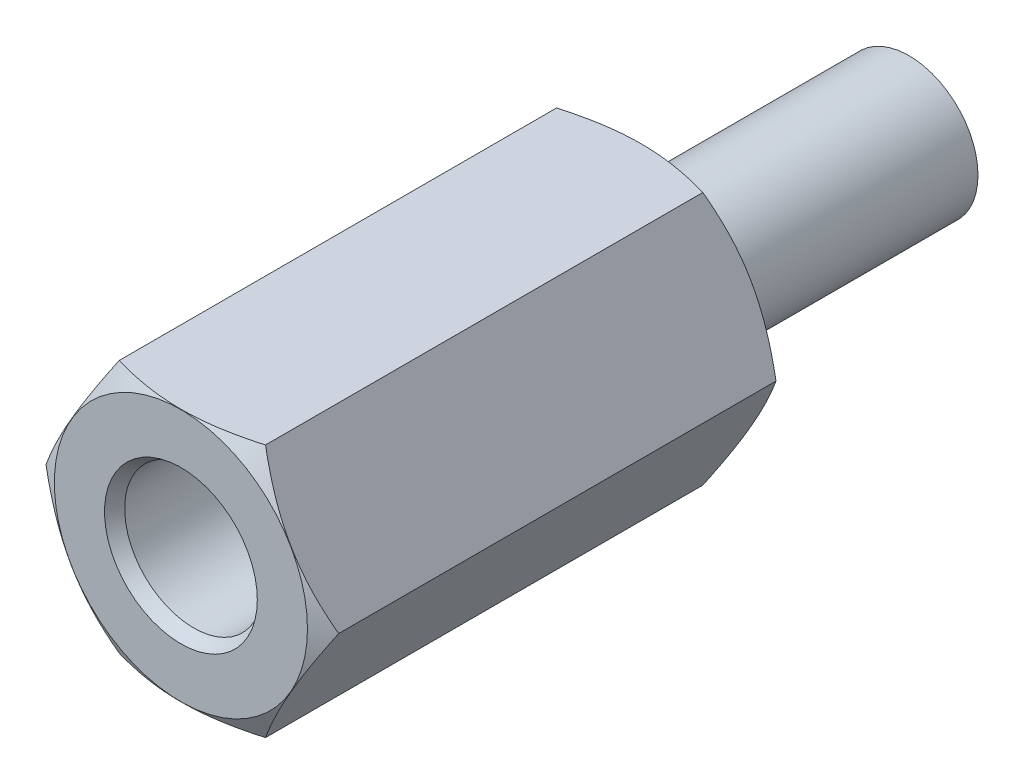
ISO-10303-21;
HEADER;
FILE_DESCRIPTION(('STEP AP214'),'2;1');
FILE_NAME('part.step','',(''),(''),'','','');
FILE_SCHEMA(('AUTOMOTIVE_DESIGN { 1 0 10303 214 1 1 1 1 }'));
ENDSEC;
DATA;
#1=APPLICATION_CONTEXT('core data for automotive mechanical design processes');
#2=APPLICATION_PROTOCOL_DEFINITION('international standard','automotive_design',2000,#1);
#3=PRODUCT_CONTEXT('',#1,'mechanical');
#4=PRODUCT('Part','Part','',(#3));
#5=PRODUCT_RELATED_PRODUCT_CATEGORY('part','',(#4));
#6=PRODUCT_DEFINITION_FORMATION('','',#4);
#7=PRODUCT_DEFINITION_CONTEXT('part definition',#1,'design');
#8=PRODUCT_DEFINITION('design','',#6,#7);
#9=PRODUCT_DEFINITION_SHAPE('','',#8);
#10=(LENGTH_UNIT() NAMED_UNIT(*) SI_UNIT(.MILLI.,.METRE.));
#11=(NAMED_UNIT(*) PLANE_ANGLE_UNIT() SI_UNIT($,.RADIAN.));
#12=(NAMED_UNIT(*) SI_UNIT($,.STERADIAN.) SOLID_ANGLE_UNIT());
#13=UNCERTAINTY_MEASURE_WITH_UNIT(LENGTH_MEASURE(1.E-05),#10,'distance_accuracy_value','');
#14=(GEOMETRIC_REPRESENTATION_CONTEXT(3) GLOBAL_UNCERTAINTY_ASSIGNED_CONTEXT((#13)) GLOBAL_UNIT_ASSIGNED_CONTEXT((#10,
#11,#12)) REPRESENTATION_CONTEXT('',''));
#15=CARTESIAN_POINT('',(0.,0.,0.));
#16=DIRECTION('',(0.,0.,1.));
#17=DIRECTION('',(1.,0.,0.));
#18=AXIS2_PLACEMENT_3D('',#15,#16,#17);
#19=CARTESIAN_POINT('',(0.,-1.03611947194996E-13,4.61641551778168));
#20=DIRECTION('',(0.,0.,1.));
#21=DIRECTION('',(1.00000000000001,0.,0.));
#22=AXIS2_PLACEMENT_3D('',#19,#20,#21);
#23=CONICAL_SURFACE('',#22,3.,1.047197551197);
#24=CARTESIAN_POINT('',(0.,-1.03611947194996E-13,4.61641551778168));
#25=DIRECTION('',(0.,0.,1.));
#26=DIRECTION('',(1.00000000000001,0.,0.));
#27=AXIS2_PLACEMENT_3D('',#24,#25,#26);
#28=CIRCLE('',#27,3.);
#29=CARTESIAN_POINT('',(3.00000000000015,0.,4.61641551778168));
#30=VERTEX_POINT('',#29);
#31=EDGE_CURVE('P0_E47',#30,#30,#28,.T.);
#32=ORIENTED_EDGE('',*,*,#31,.T.);
#33=DIRECTION('',(-0.866025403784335,0.,-0.50000000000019));
#34=VECTOR('',#33,1.);
#35=CARTESIAN_POINT('',(3.00000000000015,0.,4.61641551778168));
#36=LINE('',#35,#34);
#37=CARTESIAN_POINT('',(0.,-1.03611947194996E-13,2.88436471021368));
#38=VERTEX_POINT('',#37);
#39=EDGE_CURVE('P0_E11',#30,#38,#36,.T.);
#40=ORIENTED_EDGE('',*,*,#39,.T.);
#41=ORIENTED_EDGE('',*,*,#39,.F.);
#42=EDGE_LOOP('',(#32,#40,#41));
#43=FACE_BOUND('',#42,.T.);
#44=ADVANCED_FACE('P0_F38',(#43),#23,.F.);
#45=CARTESIAN_POINT('',(0.,-1.03611947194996E-13,-15.3835844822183));
#46=DIRECTION('',(0.,0.,1.));
#47=DIRECTION('',(1.00000000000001,0.,0.));
#48=AXIS2_PLACEMENT_3D('',#45,#46,#47);
#49=PLANE('',#48);
#50=CARTESIAN_POINT('',(0.,-1.03611947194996E-13,-15.3835844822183));
#51=DIRECTION('',(0.,0.,1.));
#52=DIRECTION('',(1.00000000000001,0.,0.));
#53=AXIS2_PLACEMENT_3D('',#50,#51,#52);
#54=CIRCLE('',#53,2.38);
#55=CARTESIAN_POINT('',(2.38000000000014,-1.59123098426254E-13,-15.3835844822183));
#56=VERTEX_POINT('',#55);
#57=EDGE_CURVE('P0_E169',#56,#56,#54,.T.);
#58=ORIENTED_EDGE('',*,*,#57,.F.);
#59=EDGE_LOOP('',(#58));
#60=FACE_BOUND('',#59,.T.);
#61=ADVANCED_FACE('P0_F326',(#60),#49,.F.);
#62=CARTESIAN_POINT('',(0.,-1.03611947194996E-13,16.0621592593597));
#63=DIRECTION('',(0.,0.,-1.));
#64=DIRECTION('',(1.00000000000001,0.,0.));
#65=AXIS2_PLACEMENT_3D('',#62,#63,#64);
#66=CYLINDRICAL_SURFACE('',#65,3.);
#67=CARTESIAN_POINT('',(0.,-1.03611947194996E-13,16.0621592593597));
#68=DIRECTION('',(0.,0.,1.));
#69=DIRECTION('',(1.00000000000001,0.,0.));
#70=AXIS2_PLACEMENT_3D('',#67,#68,#69);
#71=CIRCLE('',#70,3.);
#72=CARTESIAN_POINT('',(3.00000000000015,0.,16.0621592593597));
#73=VERTEX_POINT('',#72);
#74=EDGE_CURVE('P0_E212',#73,#73,#71,.T.);
#75=ORIENTED_EDGE('',*,*,#74,.T.);
#76=DIRECTION('',(0.,0.,-1.));
#77=VECTOR('',#76,1.);
#78=CARTESIAN_POINT('',(3.00000000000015,0.,16.0621592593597));
#79=LINE('',#78,#77);
#80=EDGE_CURVE('P0_E168',#73,#30,#79,.T.);
#81=ORIENTED_EDGE('',*,*,#80,.T.);
#82=ORIENTED_EDGE('',*,*,#31,.F.);
#83=ORIENTED_EDGE('',*,*,#80,.F.);
#84=EDGE_LOOP('',(#75,#81,#82,#83));
#85=FACE_BOUND('',#84,.T.);
#86=ADVANCED_FACE('P0_F330',(#85),#66,.F.);
#87=CARTESIAN_POINT('',(0.,-1.03611947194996E-13,-15.3835844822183));
#88=DIRECTION('',(0.,0.,1.));
#89=DIRECTION('',(1.00000000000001,0.,0.));
#90=AXIS2_PLACEMENT_3D('',#87,#88,#89);
#91=CONICAL_SURFACE('',#90,2.38,1.047197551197);
#92=ORIENTED_EDGE('',*,*,#57,.T.);
#93=DIRECTION('',(0.866025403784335,0.,0.50000000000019));
#94=VECTOR('',#93,1.);
#95=CARTESIAN_POINT('',(2.38000000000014,-1.59123098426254E-13,-15.3835844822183));
#96=LINE('',#95,#94);
#97=CARTESIAN_POINT('',(3.00000000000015,0.,-15.0256273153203));
#98=VERTEX_POINT('',#97);
#99=EDGE_CURVE('P0_E163',#56,#98,#96,.T.);
#100=ORIENTED_EDGE('',*,*,#99,.T.);
#101=CARTESIAN_POINT('',(0.,-1.03611947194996E-13,-15.0256273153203));
#102=DIRECTION('',(0.,0.,1.));
#103=DIRECTION('',(1.00000000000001,0.,0.));
#104=AXIS2_PLACEMENT_3D('',#101,#102,#103);
#105=CIRCLE('',#104,3.);
#106=EDGE_CURVE('P0_E181',#98,#98,#105,.T.);
#107=ORIENTED_EDGE('',*,*,#106,.F.);
#108=ORIENTED_EDGE('',*,*,#99,.F.);
#109=EDGE_LOOP('',(#92,#100,#107,#108));
#110=FACE_BOUND('',#109,.T.);
#111=ADVANCED_FACE('P0_F272',(#110),#91,.T.);
#112=CARTESIAN_POINT('',(0.,-1.03611947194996E-13,16.6164155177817));
#113=DIRECTION('',(0.,0.,1.));
#114=DIRECTION('',(1.00000000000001,0.,0.));
#115=AXIS2_PLACEMENT_3D('',#112,#113,#114);
#116=CONICAL_SURFACE('',#115,3.32,0.523598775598);
#117=CARTESIAN_POINT('',(0.,-1.03611947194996E-13,16.6164155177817));
#118=DIRECTION('',(0.,0.,1.));
#119=DIRECTION('',(1.00000000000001,0.,0.));
#120=AXIS2_PLACEMENT_3D('',#117,#118,#119);
#121=CIRCLE('',#120,3.32);
#122=CARTESIAN_POINT('',(3.32000000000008,0.,16.6164155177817));
#123=VERTEX_POINT('',#122);
#124=EDGE_CURVE('P0_E188',#123,#123,#121,.T.);
#125=ORIENTED_EDGE('',*,*,#124,.T.);
#126=DIRECTION('',(-0.500000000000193,0.,-0.866025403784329));
#127=VECTOR('',#126,1.);
#128=CARTESIAN_POINT('',(3.32000000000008,0.,16.6164155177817));
#129=LINE('',#128,#127);
#130=EDGE_CURVE('P0_E218',#123,#73,#129,.T.);
#131=ORIENTED_EDGE('',*,*,#130,.T.);
#132=ORIENTED_EDGE('',*,*,#74,.F.);
#133=ORIENTED_EDGE('',*,*,#130,.F.);
#134=EDGE_LOOP('',(#125,#131,#132,#133));
#135=FACE_BOUND('',#134,.T.);
#136=ADVANCED_FACE('P0_F336',(#135),#116,.F.);
#137=CARTESIAN_POINT('',(0.,-1.03611947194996E-13,-15.0256273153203));
#138=DIRECTION('',(0.,0.,1.));
#139=DIRECTION('',(1.00000000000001,0.,0.));
#140=AXIS2_PLACEMENT_3D('',#137,#138,#139);
#141=CYLINDRICAL_SURFACE('',#140,3.);
#142=ORIENTED_EDGE('',*,*,#106,.T.);
#143=DIRECTION('',(0.,0.,1.));
#144=VECTOR('',#143,1.);
#145=CARTESIAN_POINT('',(3.00000000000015,0.,-15.0256273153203));
#146=LINE('',#145,#144);
#147=CARTESIAN_POINT('',(3.00000000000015,0.,-3.38358448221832));
#148=VERTEX_POINT('',#147);
#149=EDGE_CURVE('P0_E187',#98,#148,#146,.T.);
#150=ORIENTED_EDGE('',*,*,#149,.T.);
#151=CARTESIAN_POINT('',(0.,-1.03611947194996E-13,-3.38358448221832));
#152=DIRECTION('',(0.,0.,1.));
#153=DIRECTION('',(1.00000000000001,0.,0.));
#154=AXIS2_PLACEMENT_3D('',#151,#152,#153);
#155=CIRCLE('',#154,3.);
#156=EDGE_CURVE('P0_E189',#148,#148,#155,.T.);
#157=ORIENTED_EDGE('',*,*,#156,.F.);
#158=ORIENTED_EDGE('',*,*,#149,.F.);
#159=EDGE_LOOP('',(#142,#150,#157,#158));
#160=FACE_BOUND('',#159,.T.);
#161=ADVANCED_FACE('P0_F268',(#160),#141,.T.);
#162=CARTESIAN_POINT('',(0.,-1.03611947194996E-13,16.6164155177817));
#163=DIRECTION('',(0.,0.,1.));
#164=DIRECTION('',(1.00000000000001,0.,0.));
#165=AXIS2_PLACEMENT_3D('',#162,#163,#164);
#166=PLANE('',#165);
#167=ORIENTED_EDGE('',*,*,#124,.F.);
#168=EDGE_LOOP('',(#167));
#169=FACE_BOUND('',#168,.T.);
#170=CARTESIAN_POINT('',(0.,-1.03611947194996E-13,16.6164155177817));
#171=DIRECTION('',(0.,0.,1.));
#172=DIRECTION('',(1.00000000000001,0.,0.));
#173=AXIS2_PLACEMENT_3D('',#170,#171,#172);
#174=CIRCLE('',#173,5.5);
#175=CARTESIAN_POINT('',(5.50000000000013,0.,16.6164155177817));
#176=VERTEX_POINT('',#175);
#177=EDGE_CURVE('P0_E134',#176,#176,#174,.T.);
#178=ORIENTED_EDGE('',*,*,#177,.T.);
#179=EDGE_LOOP('',(#178));
#180=FACE_BOUND('',#179,.T.);
#181=ADVANCED_FACE('P0_F314',(#169,#180),#166,.T.);
#182=CARTESIAN_POINT('',(0.,-1.03611947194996E-13,-3.38358448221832));
#183=DIRECTION('',(0.,0.,1.));
#184=DIRECTION('',(1.00000000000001,0.,0.));
#185=AXIS2_PLACEMENT_3D('',#182,#183,#184);
#186=PLANE('',#185);
#187=CARTESIAN_POINT('',(0.,-1.03611947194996E-13,-3.38358448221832));
#188=DIRECTION('',(0.,0.,1.));
#189=DIRECTION('',(1.00000000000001,0.,0.));
#190=AXIS2_PLACEMENT_3D('',#187,#188,#189);
#191=CIRCLE('',#190,5.5);
#192=CARTESIAN_POINT('',(5.50000000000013,0.,-3.38358448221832));
#193=VERTEX_POINT('',#192);
#194=EDGE_CURVE('P0_E211',#193,#193,#191,.T.);
#195=ORIENTED_EDGE('',*,*,#194,.F.);
#196=EDGE_LOOP('',(#195));
#197=FACE_BOUND('',#196,.T.);
#198=ORIENTED_EDGE('',*,*,#156,.T.);
#199=EDGE_LOOP('',(#198));
#200=FACE_BOUND('',#199,.T.);
#201=ADVANCED_FACE('P0_F265',(#197,#200),#186,.F.);
#202=CARTESIAN_POINT('',(-3.17999999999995,-5.50792156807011,-23.3835844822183));
#203=DIRECTION('',(0.,1.00000000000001,0.));
#204=DIRECTION('',(1.00000000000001,0.,0.));
#205=AXIS2_PLACEMENT_3D('',#202,#203,#204);
#206=PLANE('',#205);
#207=DIRECTION('',(0.,0.,1.));
#208=VECTOR('',#207,1.);
#209=CARTESIAN_POINT('',(3.18000000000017,-5.50792156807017,-23.3835844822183));
#210=LINE('',#209,#208);
#211=CARTESIAN_POINT('',(3.18000000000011,-5.50792156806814,-2.88706325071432));
#212=VERTEX_POINT('',#211);
#213=CARTESIAN_POINT('',(3.18000000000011,-5.50792156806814,16.1198942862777));
#214=VERTEX_POINT('',#213);
#215=EDGE_CURVE('P0_E220',#212,#214,#210,.T.);
#216=ORIENTED_EDGE('',*,*,#215,.T.);
#217=CARTESIAN_POINT('',(3.17999999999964,-5.50792156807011,16.119894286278));
#218=CARTESIAN_POINT('',(-2.69582349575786E-13,-5.50792156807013,17.037881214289));
#219=CARTESIAN_POINT('',(-3.18000000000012,-5.50792156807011,16.1198942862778));
#220=(BOUNDED_CURVE() B_SPLINE_CURVE(2,(#217,#218,#219),.UNSPECIFIED.,.F.,
.F.) B_SPLINE_CURVE_WITH_KNOTS((3,3),(0.,1.),
.UNSPECIFIED.) CURVE() GEOMETRIC_REPRESENTATION_ITEM() RATIONAL_B_SPLINE_CURVE((1.,
1.15470053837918,1.)) REPRESENTATION_ITEM(''));
#221=CARTESIAN_POINT('',(-3.17999999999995,-5.50792156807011,16.1198942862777));
#222=VERTEX_POINT('',#221);
#223=EDGE_CURVE('P0_E140',#214,#222,#220,.T.);
#224=ORIENTED_EDGE('',*,*,#223,.T.);
#225=DIRECTION('',(0.,0.,1.));
#226=VECTOR('',#225,1.);
#227=CARTESIAN_POINT('',(-3.17999999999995,-5.50792156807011,-23.3835844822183));
#228=LINE('',#227,#226);
#229=CARTESIAN_POINT('',(-3.17999999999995,-5.50792156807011,-2.88706325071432));
#230=VERTEX_POINT('',#229);
#231=EDGE_CURVE('P0_E110',#230,#222,#228,.T.);
#232=ORIENTED_EDGE('',*,*,#231,.F.);
#233=CARTESIAN_POINT('',(-3.17999999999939,-5.50792156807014,-2.88706325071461));
#234=CARTESIAN_POINT('',(2.83269422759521E-13,-5.50792156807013,-3.80505017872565));
#235=CARTESIAN_POINT('',(3.18000000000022,-5.50792156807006,-2.88706325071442));
#236=(BOUNDED_CURVE() B_SPLINE_CURVE(2,(#233,#234,#235),.UNSPECIFIED.,.F.,
.F.) B_SPLINE_CURVE_WITH_KNOTS((3,3),(0.,1.),
.UNSPECIFIED.) CURVE() GEOMETRIC_REPRESENTATION_ITEM() RATIONAL_B_SPLINE_CURVE((1.,
1.15470053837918,1.)) REPRESENTATION_ITEM(''));
#237=EDGE_CURVE('P0_E197',#230,#212,#236,.T.);
#238=ORIENTED_EDGE('',*,*,#237,.T.);
#239=EDGE_LOOP('',(#216,#224,#232,#238));
#240=FACE_BOUND('',#239,.T.);
#241=ADVANCED_FACE('P0_F306',(#240),#206,.F.);
#242=CARTESIAN_POINT('',(-6.35999999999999,-1.38306416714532E-13,-23.3835844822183));
#243=DIRECTION('',(0.866025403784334,0.500000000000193,0.));
#244=DIRECTION('',(0.,0.,-1.));
#245=AXIS2_PLACEMENT_3D('',#242,#243,#244);
#246=PLANE('',#245);
#247=ORIENTED_EDGE('',*,*,#231,.T.);
#248=CARTESIAN_POINT('',(-3.1799999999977,-5.5079215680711,16.1198942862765));
#249=CARTESIAN_POINT('',(-4.7699999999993,-2.75396078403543,17.0378812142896));
#250=CARTESIAN_POINT('',(-6.36000000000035,-3.25656552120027E-13,16.1198942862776));
#251=(BOUNDED_CURVE() B_SPLINE_CURVE(2,(#248,#249,#250),.UNSPECIFIED.,.F.,
.F.) B_SPLINE_CURVE_WITH_KNOTS((3,3),(0.,1.),
.UNSPECIFIED.) CURVE() GEOMETRIC_REPRESENTATION_ITEM() RATIONAL_B_SPLINE_CURVE((1.,
1.15470053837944,1.)) REPRESENTATION_ITEM(''));
#252=CARTESIAN_POINT('',(-6.35999999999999,0.,16.1198942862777));
#253=VERTEX_POINT('',#252);
#254=EDGE_CURVE('P0_E174',#222,#253,#251,.T.);
#255=ORIENTED_EDGE('',*,*,#254,.T.);
#256=DIRECTION('',(0.,0.,1.));
#257=VECTOR('',#256,1.);
#258=CARTESIAN_POINT('',(-6.35999999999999,-1.38306416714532E-13,-23.3835844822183));
#259=LINE('',#258,#257);
#260=CARTESIAN_POINT('',(-6.35999999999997,-2.49328719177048E-13,-2.88706325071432));
#261=VERTEX_POINT('',#260);
#262=EDGE_CURVE('P0_E103',#261,#253,#259,.T.);
#263=ORIENTED_EDGE('',*,*,#262,.F.);
#264=CARTESIAN_POINT('',(-6.3600000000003,-3.88106597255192E-13,-2.88706325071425));
#265=CARTESIAN_POINT('',(-4.76999999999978,-2.75396078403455,-3.80505017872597));
#266=CARTESIAN_POINT('',(-3.17999999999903,-5.5079215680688,-2.88706325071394));
#267=(BOUNDED_CURVE() B_SPLINE_CURVE(2,(#264,#265,#266),.UNSPECIFIED.,.F.,
.F.) B_SPLINE_CURVE_WITH_KNOTS((3,3),(0.,1.),
.UNSPECIFIED.) CURVE() GEOMETRIC_REPRESENTATION_ITEM() RATIONAL_B_SPLINE_CURVE((1.,
1.15470053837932,1.)) REPRESENTATION_ITEM(''));
#268=EDGE_CURVE('P0_E192',#261,#230,#267,.T.);
#269=ORIENTED_EDGE('',*,*,#268,.T.);
#270=EDGE_LOOP('',(#247,#255,#263,#269));
#271=FACE_BOUND('',#270,.T.);
#272=ADVANCED_FACE('P0_F304',(#271),#246,.F.);
#273=CARTESIAN_POINT('',(-3.17999999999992,5.5079215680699,-23.3835844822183));
#274=DIRECTION('',(0.866025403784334,-0.500000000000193,0.));
#275=DIRECTION('',(0.,0.,-1.));
#276=AXIS2_PLACEMENT_3D('',#273,#274,#275);
#277=PLANE('',#276);
#278=ORIENTED_EDGE('',*,*,#262,.T.);
#279=CARTESIAN_POINT('',(-6.36000000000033,1.18432657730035E-13,16.1198942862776));
#280=CARTESIAN_POINT('',(-4.76999999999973,2.75396078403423,17.0378812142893));
#281=CARTESIAN_POINT('',(-3.17999999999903,5.5079215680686,16.1198942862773));
#282=(BOUNDED_CURVE() B_SPLINE_CURVE(2,(#279,#280,#281),.UNSPECIFIED.,.F.,
.F.) B_SPLINE_CURVE_WITH_KNOTS((3,3),(0.,1.),
.UNSPECIFIED.) CURVE() GEOMETRIC_REPRESENTATION_ITEM() RATIONAL_B_SPLINE_CURVE((1.,
1.15470053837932,1.)) REPRESENTATION_ITEM(''));
#283=CARTESIAN_POINT('',(-3.17999999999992,5.5079215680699,16.1198942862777));
#284=VERTEX_POINT('',#283);
#285=EDGE_CURVE('P0_E170',#253,#284,#282,.T.);
#286=ORIENTED_EDGE('',*,*,#285,.T.);
#287=DIRECTION('',(0.,0.,1.));
#288=VECTOR('',#287,1.);
#289=CARTESIAN_POINT('',(-3.17999999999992,5.5079215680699,-23.3835844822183));
#290=LINE('',#289,#288);
#291=CARTESIAN_POINT('',(-3.17999999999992,5.5079215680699,-2.88706325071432));
#292=VERTEX_POINT('',#291);
#293=EDGE_CURVE('P0_E222',#292,#284,#290,.T.);
#294=ORIENTED_EDGE('',*,*,#293,.F.);
#295=CARTESIAN_POINT('',(-3.17999999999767,5.50792156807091,-2.88706325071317));
#296=CARTESIAN_POINT('',(-4.76999999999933,2.75396078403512,-3.80505017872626));
#297=CARTESIAN_POINT('',(-6.36000000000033,1.18432657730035E-13,-2.88706325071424));
#298=(BOUNDED_CURVE() B_SPLINE_CURVE(2,(#295,#296,#297),.UNSPECIFIED.,.F.,
.F.) B_SPLINE_CURVE_WITH_KNOTS((3,3),(0.,1.),
.UNSPECIFIED.) CURVE() GEOMETRIC_REPRESENTATION_ITEM() RATIONAL_B_SPLINE_CURVE((1.,
1.15470053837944,1.)) REPRESENTATION_ITEM(''));
#299=EDGE_CURVE('P0_E196',#292,#261,#298,.T.);
#300=ORIENTED_EDGE('',*,*,#299,.T.);
#301=EDGE_LOOP('',(#278,#286,#294,#300));
#302=FACE_BOUND('',#301,.T.);
#303=ADVANCED_FACE('P0_F301',(#302),#277,.F.);
#304=CARTESIAN_POINT('',(3.18000000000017,-5.50792156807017,-23.3835844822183));
#305=DIRECTION('',(-0.866025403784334,0.500000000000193,0.));
#306=DIRECTION('',(0.,0.,1.));
#307=AXIS2_PLACEMENT_3D('',#304,#305,#306);
#308=PLANE('',#307);
#309=DIRECTION('',(0.,0.,1.));
#310=VECTOR('',#309,1.);
#311=CARTESIAN_POINT('',(6.36000000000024,-1.10550841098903E-13,-2.88706325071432));
#312=LINE('',#311,#310);
#313=CARTESIAN_POINT('',(6.36000000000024,-1.10550841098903E-13,-2.88706325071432));
#314=VERTEX_POINT('',#313);
#315=CARTESIAN_POINT('',(6.36000000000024,-1.10550841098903E-13,16.1198942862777));
#316=VERTEX_POINT('',#315);
#317=EDGE_CURVE('P0_E144',#314,#316,#312,.T.);
#318=ORIENTED_EDGE('',*,*,#317,.T.);
#319=CARTESIAN_POINT('',(6.36000000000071,0.,16.1198942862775));
#320=CARTESIAN_POINT('',(4.77000000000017,-2.75396078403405,17.0378812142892));
#321=CARTESIAN_POINT('',(3.17999999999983,-5.50792156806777,16.1198942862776));
#322=(BOUNDED_CURVE() B_SPLINE_CURVE(2,(#319,#320,#321),.UNSPECIFIED.,.F.,
.F.) B_SPLINE_CURVE_WITH_KNOTS((3,3),(0.,1.),
.UNSPECIFIED.) CURVE() GEOMETRIC_REPRESENTATION_ITEM() RATIONAL_B_SPLINE_CURVE((1.,
1.15470053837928,1.)) REPRESENTATION_ITEM(''));
#323=EDGE_CURVE('P0_E135',#316,#214,#322,.T.);
#324=ORIENTED_EDGE('',*,*,#323,.T.);
#325=ORIENTED_EDGE('',*,*,#215,.F.);
#326=CARTESIAN_POINT('',(3.17999999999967,-5.50792156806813,-2.88706325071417));
#327=CARTESIAN_POINT('',(4.7700000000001,-2.75396078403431,-3.80505017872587));
#328=CARTESIAN_POINT('',(6.36000000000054,-3.88106597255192E-13,-2.88706325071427));
#329=(BOUNDED_CURVE() B_SPLINE_CURVE(2,(#326,#327,#328),.UNSPECIFIED.,.F.,
.F.) B_SPLINE_CURVE_WITH_KNOTS((3,3),(0.,1.),
.UNSPECIFIED.) CURVE() GEOMETRIC_REPRESENTATION_ITEM() RATIONAL_B_SPLINE_CURVE((1.,
1.15470053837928,1.)) REPRESENTATION_ITEM(''));
#330=EDGE_CURVE('P0_E120',#212,#314,#329,.T.);
#331=ORIENTED_EDGE('',*,*,#330,.T.);
#332=EDGE_LOOP('',(#318,#324,#325,#331));
#333=FACE_BOUND('',#332,.T.);
#334=ADVANCED_FACE('P0_F145',(#333),#308,.F.);
#335=CARTESIAN_POINT('',(0.,-1.03611947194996E-13,16.1198942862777));
#336=DIRECTION('',(0.,0.,-1.));
#337=DIRECTION('',(1.00000000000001,0.,0.));
#338=AXIS2_PLACEMENT_3D('',#335,#336,#337);
#339=CONICAL_SURFACE('',#338,6.36,1.047197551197);
#340=ORIENTED_EDGE('',*,*,#323,.F.);
#341=DIRECTION('',(-0.866025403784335,0.,0.50000000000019));
#342=VECTOR('',#341,1.);
#343=CARTESIAN_POINT('',(6.36000000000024,-1.10550841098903E-13,16.1198942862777));
#344=LINE('',#343,#342);
#345=EDGE_CURVE('P0_E127',#316,#176,#344,.T.);
#346=ORIENTED_EDGE('',*,*,#345,.T.);
#347=ORIENTED_EDGE('',*,*,#177,.F.);
#348=ORIENTED_EDGE('',*,*,#345,.F.);
#349=CARTESIAN_POINT('',(3.17999999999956,5.50792156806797,16.1198942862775));
#350=CARTESIAN_POINT('',(4.77000000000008,2.75396078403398,17.0378812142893));
#351=CARTESIAN_POINT('',(6.36000000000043,2.36393854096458E-13,16.1198942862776));
#352=(BOUNDED_CURVE() B_SPLINE_CURVE(2,(#349,#350,#351),.UNSPECIFIED.,.F.,
.F.) B_SPLINE_CURVE_WITH_KNOTS((3,3),(0.,1.),
.UNSPECIFIED.) CURVE() GEOMETRIC_REPRESENTATION_ITEM() RATIONAL_B_SPLINE_CURVE((1.,
1.15470053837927,1.)) REPRESENTATION_ITEM(''));
#353=CARTESIAN_POINT('',(3.18000000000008,5.50792156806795,16.1198942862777));
#354=VERTEX_POINT('',#353);
#355=EDGE_CURVE('P0_E132',#354,#316,#352,.T.);
#356=ORIENTED_EDGE('',*,*,#355,.F.);
#357=CARTESIAN_POINT('',(-3.17999999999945,5.50792156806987,16.119894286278));
#358=CARTESIAN_POINT('',(2.59232389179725E-13,5.50792156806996,17.037881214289));
#359=CARTESIAN_POINT('',(3.1800000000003,5.50792156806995,16.1198942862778));
#360=(BOUNDED_CURVE() B_SPLINE_CURVE(2,(#357,#358,#359),.UNSPECIFIED.,.F.,
.F.) B_SPLINE_CURVE_WITH_KNOTS((3,3),(0.,1.),
.UNSPECIFIED.) CURVE() GEOMETRIC_REPRESENTATION_ITEM() RATIONAL_B_SPLINE_CURVE((1.,
1.15470053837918,1.)) REPRESENTATION_ITEM(''));
#361=EDGE_CURVE('P0_E141',#284,#354,#360,.T.);
#362=ORIENTED_EDGE('',*,*,#361,.F.);
#363=ORIENTED_EDGE('',*,*,#285,.F.);
#364=ORIENTED_EDGE('',*,*,#254,.F.);
#365=ORIENTED_EDGE('',*,*,#223,.F.);
#366=EDGE_LOOP('',(#340,#346,#347,#348,#356,#362,#363,#364,#365));
#367=FACE_BOUND('',#366,.T.);
#368=ADVANCED_FACE('P0_F129',(#367),#339,.T.);
#369=CARTESIAN_POINT('',(3.18000000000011,5.50792156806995,-23.3835844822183));
#370=DIRECTION('',(0.,-1.00000000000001,0.));
#371=DIRECTION('',(-1.00000000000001,0.,0.));
#372=AXIS2_PLACEMENT_3D('',#369,#370,#371);
#373=PLANE('',#372);
#374=ORIENTED_EDGE('',*,*,#293,.T.);
#375=ORIENTED_EDGE('',*,*,#361,.T.);
#376=DIRECTION('',(0.,0.,1.));
#377=VECTOR('',#376,1.);
#378=CARTESIAN_POINT('',(3.18000000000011,5.50792156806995,-23.3835844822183));
#379=LINE('',#378,#377);
#380=CARTESIAN_POINT('',(3.18000000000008,5.50792156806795,-2.88706325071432));
#381=VERTEX_POINT('',#380);
#382=EDGE_CURVE('P0_E153',#381,#354,#379,.T.);
#383=ORIENTED_EDGE('',*,*,#382,.F.);
#384=CARTESIAN_POINT('',(3.17999999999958,5.50792156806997,-2.88706325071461));
#385=CARTESIAN_POINT('',(-1.73434215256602E-13,5.50792156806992,-3.80505017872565));
#386=CARTESIAN_POINT('',(-3.18000000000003,5.50792156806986,-2.88706325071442));
#387=(BOUNDED_CURVE() B_SPLINE_CURVE(2,(#384,#385,#386),.UNSPECIFIED.,.F.,
.F.) B_SPLINE_CURVE_WITH_KNOTS((3,3),(0.,1.),
.UNSPECIFIED.) CURVE() GEOMETRIC_REPRESENTATION_ITEM() RATIONAL_B_SPLINE_CURVE((1.,
1.15470053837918,1.)) REPRESENTATION_ITEM(''));
#388=EDGE_CURVE('P0_E225',#381,#292,#387,.T.);
#389=ORIENTED_EDGE('',*,*,#388,.T.);
#390=EDGE_LOOP('',(#374,#375,#383,#389));
#391=FACE_BOUND('',#390,.T.);
#392=ADVANCED_FACE('P0_F298',(#391),#373,.F.);
#393=CARTESIAN_POINT('',(0.,-1.03611947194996E-13,-3.38358448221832));
#394=DIRECTION('',(0.,0.,1.));
#395=DIRECTION('',(1.00000000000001,0.,0.));
#396=AXIS2_PLACEMENT_3D('',#393,#394,#395);
#397=CONICAL_SURFACE('',#396,5.5,1.047197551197);
#398=DIRECTION('',(0.866025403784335,0.,0.50000000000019));
#399=VECTOR('',#398,1.);
#400=CARTESIAN_POINT('',(5.50000000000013,0.,-3.38358448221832));
#401=LINE('',#400,#399);
#402=EDGE_CURVE('P0_E204',#193,#314,#401,.T.);
#403=ORIENTED_EDGE('',*,*,#402,.F.);
#404=ORIENTED_EDGE('',*,*,#194,.T.);
#405=ORIENTED_EDGE('',*,*,#402,.T.);
#406=ORIENTED_EDGE('',*,*,#330,.F.);
#407=ORIENTED_EDGE('',*,*,#237,.F.);
#408=ORIENTED_EDGE('',*,*,#268,.F.);
#409=ORIENTED_EDGE('',*,*,#299,.F.);
#410=ORIENTED_EDGE('',*,*,#388,.F.);
#411=CARTESIAN_POINT('',(6.36000000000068,-1.10550841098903E-13,-2.88706325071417));
#412=CARTESIAN_POINT('',(4.77000000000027,2.75396078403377,-3.80505017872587));
#413=CARTESIAN_POINT('',(3.17999999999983,5.50792156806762,-2.88706325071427));
#414=(BOUNDED_CURVE() B_SPLINE_CURVE(2,(#411,#412,#413),.UNSPECIFIED.,.F.,
.F.) B_SPLINE_CURVE_WITH_KNOTS((3,3),(0.,1.),
.UNSPECIFIED.) CURVE() GEOMETRIC_REPRESENTATION_ITEM() RATIONAL_B_SPLINE_CURVE((1.,
1.15470053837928,1.)) REPRESENTATION_ITEM(''));
#415=EDGE_CURVE('P0_E149',#314,#381,#414,.T.);
#416=ORIENTED_EDGE('',*,*,#415,.F.);
#417=EDGE_LOOP('',(#403,#404,#405,#406,#407,#408,#409,#410,#416));
#418=FACE_BOUND('',#417,.T.);
#419=ADVANCED_FACE('P0_F309',(#418),#397,.T.);
#420=CARTESIAN_POINT('',(6.36000000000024,-1.10550841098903E-13,-23.3835844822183));
#421=DIRECTION('',(-0.866025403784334,-0.500000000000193,0.));
#422=DIRECTION('',(-0.500000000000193,0.866025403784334,0.));
#423=AXIS2_PLACEMENT_3D('',#420,#421,#422);
#424=PLANE('',#423);
#425=ORIENTED_EDGE('',*,*,#382,.T.);
#426=ORIENTED_EDGE('',*,*,#355,.T.);
#427=ORIENTED_EDGE('',*,*,#317,.F.);
#428=ORIENTED_EDGE('',*,*,#415,.T.);
#429=EDGE_LOOP('',(#425,#426,#427,#428));
#430=FACE_BOUND('',#429,.T.);
#431=ADVANCED_FACE('P0_F151',(#430),#424,.F.);
#432=CLOSED_SHELL('',(#44,#61,#86,#111,#136,#161,#181,#201,#241,#272,#303,#334,#368,#392,#419,#431));
#433=MANIFOLD_SOLID_BREP('P0_B2',#432);
#434=CARTESIAN_POINT('',(0.,0.,4.));
#435=DIRECTION('',(0.,0.,1.));
#436=DIRECTION('',(1.00000000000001,0.,0.));
#437=AXIS2_PLACEMENT_3D('',#434,#435,#436);
#438=CONICAL_SURFACE('',#437,1.5,1.047197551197);
#439=CARTESIAN_POINT('',(0.,0.,4.));
#440=DIRECTION('',(0.,0.,1.));
#441=DIRECTION('',(1.00000000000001,0.,0.));
#442=AXIS2_PLACEMENT_3D('',#439,#440,#441);
#443=CIRCLE('',#442,1.5);
#444=CARTESIAN_POINT('',(1.50000000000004,0.,4.));
#445=VERTEX_POINT('',#444);
#446=EDGE_CURVE('P1_E28',#445,#445,#443,.T.);
#447=ORIENTED_EDGE('',*,*,#446,.T.);
#448=DIRECTION('',(-0.866025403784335,0.,-0.50000000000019));
#449=VECTOR('',#448,1.);
#450=CARTESIAN_POINT('',(1.50000000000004,0.,4.));
#451=LINE('',#450,#449);
#452=CARTESIAN_POINT('',(0.,0.,3.133974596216));
#453=VERTEX_POINT('',#452);
#454=EDGE_CURVE('P1_E11',#445,#453,#451,.T.);
#455=ORIENTED_EDGE('',*,*,#454,.T.);
#456=ORIENTED_EDGE('',*,*,#454,.F.);
#457=EDGE_LOOP('',(#447,#455,#456));
#458=FACE_BOUND('',#457,.T.);
#459=ADVANCED_FACE('P1_F16',(#458),#438,.F.);
#460=CARTESIAN_POINT('',(0.,0.,-6.));
#461=DIRECTION('',(0.,0.,1.));
#462=DIRECTION('',(1.00000000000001,0.,0.));
#463=AXIS2_PLACEMENT_3D('',#460,#461,#462);
#464=PLANE('',#463);
#465=CARTESIAN_POINT('',(0.,0.,-6.));
#466=DIRECTION('',(0.,0.,1.));
#467=DIRECTION('',(1.00000000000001,0.,0.));
#468=AXIS2_PLACEMENT_3D('',#465,#466,#467);
#469=CIRCLE('',#468,1.19);
#470=CARTESIAN_POINT('',(1.19000000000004,0.,-6.));
#471=VERTEX_POINT('',#470);
#472=EDGE_CURVE('P1_E193',#471,#471,#469,.T.);
#473=ORIENTED_EDGE('',*,*,#472,.F.);
#474=EDGE_LOOP('',(#473));
#475=FACE_BOUND('',#474,.T.);
#476=ADVANCED_FACE('P1_F296',(#475),#464,.F.);
#477=CARTESIAN_POINT('',(0.,0.,9.722871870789));
#478=DIRECTION('',(0.,0.,-1.));
#479=DIRECTION('',(1.00000000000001,0.,0.));
#480=AXIS2_PLACEMENT_3D('',#477,#478,#479);
#481=CYLINDRICAL_SURFACE('',#480,1.5);
#482=CARTESIAN_POINT('',(0.,0.,9.722871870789));
#483=DIRECTION('',(0.,0.,1.));
#484=DIRECTION('',(1.00000000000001,0.,0.));
#485=AXIS2_PLACEMENT_3D('',#482,#483,#484);
#486=CIRCLE('',#485,1.5);
#487=CARTESIAN_POINT('',(1.50000000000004,0.,9.722871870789));
#488=VERTEX_POINT('',#487);
#489=EDGE_CURVE('P1_E187',#488,#488,#486,.T.);
#490=ORIENTED_EDGE('',*,*,#489,.T.);
#491=DIRECTION('',(0.,0.,-1.));
#492=VECTOR('',#491,1.);
#493=CARTESIAN_POINT('',(1.50000000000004,0.,9.722871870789));
#494=LINE('',#493,#492);
#495=EDGE_CURVE('P1_E192',#488,#445,#494,.T.);
#496=ORIENTED_EDGE('',*,*,#495,.T.);
#497=ORIENTED_EDGE('',*,*,#446,.F.);
#498=ORIENTED_EDGE('',*,*,#495,.F.);
#499=EDGE_LOOP('',(#490,#496,#497,#498));
#500=FACE_BOUND('',#499,.T.);
#501=ADVANCED_FACE('P1_F300',(#500),#481,.F.);
#502=CARTESIAN_POINT('',(0.,0.,-6.));
#503=DIRECTION('',(0.,0.,1.));
#504=DIRECTION('',(1.00000000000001,0.,0.));
#505=AXIS2_PLACEMENT_3D('',#502,#503,#504);
#506=CONICAL_SURFACE('',#505,1.19,1.047197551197);
#507=ORIENTED_EDGE('',*,*,#472,.T.);
#508=DIRECTION('',(0.866025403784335,0.,0.50000000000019));
#509=VECTOR('',#508,1.);
#510=CARTESIAN_POINT('',(1.19000000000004,0.,-6.));
#511=LINE('',#510,#509);
#512=CARTESIAN_POINT('',(1.50000000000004,0.,-5.821021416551));
#513=VERTEX_POINT('',#512);
#514=EDGE_CURVE('P1_E189',#471,#513,#511,.T.);
#515=ORIENTED_EDGE('',*,*,#514,.T.);
#516=CARTESIAN_POINT('',(0.,0.,-5.821021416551));
#517=DIRECTION('',(0.,0.,1.));
#518=DIRECTION('',(1.00000000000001,0.,0.));
#519=AXIS2_PLACEMENT_3D('',#516,#517,#518);
#520=CIRCLE('',#519,1.5);
#521=EDGE_CURVE('P1_E207',#513,#513,#520,.T.);
#522=ORIENTED_EDGE('',*,*,#521,.F.);
#523=ORIENTED_EDGE('',*,*,#514,.F.);
#524=EDGE_LOOP('',(#507,#515,#522,#523));
#525=FACE_BOUND('',#524,.T.);
#526=ADVANCED_FACE('P1_F360',(#525),#506,.T.);
#527=CARTESIAN_POINT('',(0.,0.,10.));
#528=DIRECTION('',(0.,0.,1.));
#529=DIRECTION('',(1.00000000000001,0.,0.));
#530=AXIS2_PLACEMENT_3D('',#527,#528,#529);
#531=CONICAL_SURFACE('',#530,1.66,0.523598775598);
#532=CARTESIAN_POINT('',(0.,0.,10.));
#533=DIRECTION('',(0.,0.,1.));
#534=DIRECTION('',(1.00000000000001,0.,0.));
#535=AXIS2_PLACEMENT_3D('',#532,#533,#534);
#536=CIRCLE('',#535,1.66);
#537=CARTESIAN_POINT('',(1.66000000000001,0.,10.));
#538=VERTEX_POINT('',#537);
#539=EDGE_CURVE('P1_E175',#538,#538,#536,.T.);
#540=ORIENTED_EDGE('',*,*,#539,.T.);
#541=DIRECTION('',(-0.500000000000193,0.,-0.866025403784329));
#542=VECTOR('',#541,1.);
#543=CARTESIAN_POINT('',(1.66000000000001,0.,10.));
#544=LINE('',#543,#542);
#545=EDGE_CURVE('P1_E183',#538,#488,#544,.T.);
#546=ORIENTED_EDGE('',*,*,#545,.T.);
#547=ORIENTED_EDGE('',*,*,#489,.F.);
#548=ORIENTED_EDGE('',*,*,#545,.F.);
#549=EDGE_LOOP('',(#540,#546,#547,#548));
#550=FACE_BOUND('',#549,.T.);
#551=ADVANCED_FACE('P1_F290',(#550),#531,.F.);
#552=CARTESIAN_POINT('',(0.,0.,-5.821021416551));
#553=DIRECTION('',(0.,0.,1.));
#554=DIRECTION('',(1.00000000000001,0.,0.));
#555=AXIS2_PLACEMENT_3D('',#552,#553,#554);
#556=CYLINDRICAL_SURFACE('',#555,1.5);
#557=ORIENTED_EDGE('',*,*,#521,.T.);
#558=DIRECTION('',(0.,0.,1.));
#559=VECTOR('',#558,1.);
#560=CARTESIAN_POINT('',(1.50000000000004,0.,-5.821021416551));
#561=LINE('',#560,#559);
#562=CARTESIAN_POINT('',(1.50000000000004,0.,0.));
#563=VERTEX_POINT('',#562);
#564=EDGE_CURVE('P1_E188',#513,#563,#561,.T.);
#565=ORIENTED_EDGE('',*,*,#564,.T.);
#566=CARTESIAN_POINT('',(0.,0.,0.));
#567=DIRECTION('',(0.,0.,1.));
#568=DIRECTION('',(1.00000000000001,0.,0.));
#569=AXIS2_PLACEMENT_3D('',#566,#567,#568);
#570=CIRCLE('',#569,1.5);
#571=EDGE_CURVE('P1_E215',#563,#563,#570,.T.);
#572=ORIENTED_EDGE('',*,*,#571,.F.);
#573=ORIENTED_EDGE('',*,*,#564,.F.);
#574=EDGE_LOOP('',(#557,#565,#572,#573));
#575=FACE_BOUND('',#574,.T.);
#576=ADVANCED_FACE('P1_F279',(#575),#556,.T.);
#577=CARTESIAN_POINT('',(0.,0.,10.));
#578=DIRECTION('',(0.,0.,1.));
#579=DIRECTION('',(1.00000000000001,0.,0.));
#580=AXIS2_PLACEMENT_3D('',#577,#578,#579);
#581=PLANE('',#580);
#582=ORIENTED_EDGE('',*,*,#539,.F.);
#583=EDGE_LOOP('',(#582));
#584=FACE_BOUND('',#583,.T.);
#585=CARTESIAN_POINT('',(0.,0.,10.));
#586=DIRECTION('',(0.,0.,1.));
#587=DIRECTION('',(1.00000000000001,0.,0.));
#588=AXIS2_PLACEMENT_3D('',#585,#586,#587);
#589=CIRCLE('',#588,2.75);
#590=CARTESIAN_POINT('',(2.75000000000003,0.,10.));
#591=VERTEX_POINT('',#590);
#592=EDGE_CURVE('P1_E144',#591,#591,#589,.T.);
#593=ORIENTED_EDGE('',*,*,#592,.T.);
#594=EDGE_LOOP('',(#593));
#595=FACE_BOUND('',#594,.T.);
#596=ADVANCED_FACE('P1_F276',(#584,#595),#581,.T.);
#597=CARTESIAN_POINT('',(0.,0.,0.));
#598=DIRECTION('',(0.,0.,1.));
#599=DIRECTION('',(1.00000000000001,0.,0.));
#600=AXIS2_PLACEMENT_3D('',#597,#598,#599);
#601=PLANE('',#600);
#602=CARTESIAN_POINT('',(0.,0.,0.));
#603=DIRECTION('',(0.,0.,1.));
#604=DIRECTION('',(1.00000000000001,0.,0.));
#605=AXIS2_PLACEMENT_3D('',#602,#603,#604);
#606=CIRCLE('',#605,2.75);
#607=CARTESIAN_POINT('',(2.75000000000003,0.,0.));
#608=VERTEX_POINT('',#607);
#609=EDGE_CURVE('P1_E177',#608,#608,#606,.T.);
#610=ORIENTED_EDGE('',*,*,#609,.F.);
#611=EDGE_LOOP('',(#610));
#612=FACE_BOUND('',#611,.T.);
#613=ORIENTED_EDGE('',*,*,#571,.T.);
#614=EDGE_LOOP('',(#613));
#615=FACE_BOUND('',#614,.T.);
#616=ADVANCED_FACE('P1_F278',(#612,#615),#601,.F.);
#617=CARTESIAN_POINT('',(-1.59000000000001,-2.753960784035,-10.));
#618=DIRECTION('',(0.,1.00000000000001,0.));
#619=DIRECTION('',(1.00000000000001,0.,0.));
#620=AXIS2_PLACEMENT_3D('',#617,#618,#619);
#621=PLANE('',#620);
#622=DIRECTION('',(0.,0.,1.));
#623=VECTOR('',#622,1.);
#624=CARTESIAN_POINT('',(1.59000000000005,-2.75396078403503,-10.));
#625=LINE('',#624,#623);
#626=CARTESIAN_POINT('',(1.59000000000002,-2.75396078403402,0.248260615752));
#627=VERTEX_POINT('',#626);
#628=CARTESIAN_POINT('',(1.59000000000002,-2.75396078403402,9.751739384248));
#629=VERTEX_POINT('',#628);
#630=EDGE_CURVE('P1_E255',#627,#629,#625,.T.);
#631=ORIENTED_EDGE('',*,*,#630,.T.);
#632=CARTESIAN_POINT('',(1.58999999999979,-2.753960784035,9.75173938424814));
#633=CARTESIAN_POINT('',(-1.68259235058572E-13,-2.75396078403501,10.2107328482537));
#634=CARTESIAN_POINT('',(-1.59000000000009,-2.753960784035,9.75173938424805));
#635=(BOUNDED_CURVE() B_SPLINE_CURVE(2,(#632,#633,#634),.UNSPECIFIED.,.F.,
.F.) B_SPLINE_CURVE_WITH_KNOTS((3,3),(0.,1.),
.UNSPECIFIED.) CURVE() GEOMETRIC_REPRESENTATION_ITEM() RATIONAL_B_SPLINE_CURVE((1.,
1.15470053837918,1.)) REPRESENTATION_ITEM(''));
#636=CARTESIAN_POINT('',(-1.59000000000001,-2.753960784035,9.751739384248));
#637=VERTEX_POINT('',#636);
#638=EDGE_CURVE('P1_E150',#629,#637,#635,.T.);
#639=ORIENTED_EDGE('',*,*,#638,.T.);
#640=DIRECTION('',(0.,0.,1.));
#641=VECTOR('',#640,1.);
#642=CARTESIAN_POINT('',(-1.59000000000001,-2.753960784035,-10.));
#643=LINE('',#642,#641);
#644=CARTESIAN_POINT('',(-1.59000000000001,-2.753960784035,0.248260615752));
#645=VERTEX_POINT('',#644);
#646=EDGE_CURVE('P1_E114',#645,#637,#643,.T.);
#647=ORIENTED_EDGE('',*,*,#646,.F.);
#648=CARTESIAN_POINT('',(-1.58999999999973,-2.75396078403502,0.248260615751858));
#649=CARTESIAN_POINT('',(1.08166651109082E-13,-2.75396078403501,-0.210732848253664));
#650=CARTESIAN_POINT('',(1.59000000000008,-2.75396078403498,0.248260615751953));
#651=(BOUNDED_CURVE() B_SPLINE_CURVE(2,(#648,#649,#650),.UNSPECIFIED.,.F.,
.F.) B_SPLINE_CURVE_WITH_KNOTS((3,3),(0.,1.),
.UNSPECIFIED.) CURVE() GEOMETRIC_REPRESENTATION_ITEM() RATIONAL_B_SPLINE_CURVE((1.,
1.15470053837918,1.)) REPRESENTATION_ITEM(''));
#652=EDGE_CURVE('P1_E229',#645,#627,#651,.T.);
#653=ORIENTED_EDGE('',*,*,#652,.T.);
#654=EDGE_LOOP('',(#631,#639,#647,#653));
#655=FACE_BOUND('',#654,.T.);
#656=ADVANCED_FACE('P1_F287',(#655),#621,.F.);
#657=CARTESIAN_POINT('',(-3.18000000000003,0.,-10.));
#658=DIRECTION('',(0.866025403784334,0.500000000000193,0.));
#659=DIRECTION('',(0.,0.,-1.));
#660=AXIS2_PLACEMENT_3D('',#657,#658,#659);
#661=PLANE('',#660);
#662=ORIENTED_EDGE('',*,*,#646,.T.);
#663=CARTESIAN_POINT('',(-1.58999999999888,-2.7539607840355,9.75173938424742));
#664=CARTESIAN_POINT('',(-2.38499999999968,-1.37698039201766,10.210732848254));
#665=CARTESIAN_POINT('',(-3.18000000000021,-1.11022302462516E-13,9.75173938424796));
#666=(BOUNDED_CURVE() B_SPLINE_CURVE(2,(#663,#664,#665),.UNSPECIFIED.,.F.,
.F.) B_SPLINE_CURVE_WITH_KNOTS((3,3),(0.,1.),
.UNSPECIFIED.) CURVE() GEOMETRIC_REPRESENTATION_ITEM() RATIONAL_B_SPLINE_CURVE((1.,
1.15470053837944,1.)) REPRESENTATION_ITEM(''));
#667=CARTESIAN_POINT('',(-3.18000000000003,0.,9.751739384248));
#668=VERTEX_POINT('',#667);
#669=EDGE_CURVE('P1_E199',#637,#668,#666,.T.);
#670=ORIENTED_EDGE('',*,*,#669,.T.);
#671=DIRECTION('',(0.,0.,1.));
#672=VECTOR('',#671,1.);
#673=CARTESIAN_POINT('',(-3.18000000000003,0.,-10.));
#674=LINE('',#673,#672);
#675=CARTESIAN_POINT('',(-3.18000000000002,0.,0.248260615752));
#676=VERTEX_POINT('',#675);
#677=EDGE_CURVE('P1_E104',#676,#668,#674,.T.);
#678=ORIENTED_EDGE('',*,*,#677,.F.);
#679=CARTESIAN_POINT('',(-3.18000000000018,-1.42247325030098E-13,0.248260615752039));
#680=CARTESIAN_POINT('',(-2.38499999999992,-1.37698039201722,-0.210732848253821));
#681=CARTESIAN_POINT('',(-1.58999999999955,-2.75396078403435,0.248260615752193));
#682=(BOUNDED_CURVE() B_SPLINE_CURVE(2,(#679,#680,#681),.UNSPECIFIED.,.F.,
.F.) B_SPLINE_CURVE_WITH_KNOTS((3,3),(0.,1.),
.UNSPECIFIED.) CURVE() GEOMETRIC_REPRESENTATION_ITEM() RATIONAL_B_SPLINE_CURVE((1.,
1.15470053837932,1.)) REPRESENTATION_ITEM(''));
#683=EDGE_CURVE('P1_E223',#676,#645,#682,.T.);
#684=ORIENTED_EDGE('',*,*,#683,.T.);
#685=EDGE_LOOP('',(#662,#670,#678,#684));
#686=FACE_BOUND('',#685,.T.);
#687=ADVANCED_FACE('P1_F337',(#686),#661,.F.);
#688=CARTESIAN_POINT('',(-1.58999999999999,2.753960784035,-10.));
#689=DIRECTION('',(0.866025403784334,-0.500000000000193,0.));
#690=DIRECTION('',(0.,0.,-1.));
#691=AXIS2_PLACEMENT_3D('',#688,#689,#690);
#692=PLANE('',#691);
#693=ORIENTED_EDGE('',*,*,#677,.T.);
#694=CARTESIAN_POINT('',(-3.1800000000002,1.11022302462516E-13,9.75173938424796));
#695=CARTESIAN_POINT('',(-2.3849999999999,1.37698039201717,10.2107328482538));
#696=CARTESIAN_POINT('',(-1.58999999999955,2.75396078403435,9.75173938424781));
#697=(BOUNDED_CURVE() B_SPLINE_CURVE(2,(#694,#695,#696),.UNSPECIFIED.,.F.,
.F.) B_SPLINE_CURVE_WITH_KNOTS((3,3),(0.,1.),
.UNSPECIFIED.) CURVE() GEOMETRIC_REPRESENTATION_ITEM() RATIONAL_B_SPLINE_CURVE((1.,
1.15470053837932,1.)) REPRESENTATION_ITEM(''));
#698=CARTESIAN_POINT('',(-1.58999999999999,2.753960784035,9.751739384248));
#699=VERTEX_POINT('',#698);
#700=EDGE_CURVE('P1_E194',#668,#699,#697,.T.);
#701=ORIENTED_EDGE('',*,*,#700,.T.);
#702=DIRECTION('',(0.,0.,1.));
#703=VECTOR('',#702,1.);
#704=CARTESIAN_POINT('',(-1.58999999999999,2.753960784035,-10.));
#705=LINE('',#704,#703);
#706=CARTESIAN_POINT('',(-1.58999999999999,2.753960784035,0.248260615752));
#707=VERTEX_POINT('',#706);
#708=EDGE_CURVE('P1_E258',#707,#699,#705,.T.);
#709=ORIENTED_EDGE('',*,*,#708,.F.);
#710=CARTESIAN_POINT('',(-1.58999999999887,2.75396078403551,0.248260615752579));
#711=CARTESIAN_POINT('',(-2.3849999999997,1.37698039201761,-0.210732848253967));
#712=CARTESIAN_POINT('',(-3.1800000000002,1.11022302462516E-13,0.24826061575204));
#713=(BOUNDED_CURVE() B_SPLINE_CURVE(2,(#710,#711,#712),.UNSPECIFIED.,.F.,
.F.) B_SPLINE_CURVE_WITH_KNOTS((3,3),(0.,1.),
.UNSPECIFIED.) CURVE() GEOMETRIC_REPRESENTATION_ITEM() RATIONAL_B_SPLINE_CURVE((1.,
1.15470053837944,1.)) REPRESENTATION_ITEM(''));
#714=EDGE_CURVE('P1_E228',#707,#676,#713,.T.);
#715=ORIENTED_EDGE('',*,*,#714,.T.);
#716=EDGE_LOOP('',(#693,#701,#709,#715));
#717=FACE_BOUND('',#716,.T.);
#718=ADVANCED_FACE('P1_F350',(#717),#692,.F.);
#719=CARTESIAN_POINT('',(1.59000000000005,-2.75396078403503,-10.));
#720=DIRECTION('',(-0.866025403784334,0.500000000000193,0.));
#721=DIRECTION('',(0.,0.,1.));
#722=AXIS2_PLACEMENT_3D('',#719,#720,#721);
#723=PLANE('',#722);
#724=DIRECTION('',(0.,0.,1.));
#725=VECTOR('',#724,1.);
#726=CARTESIAN_POINT('',(3.18000000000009,0.,0.248260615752));
#727=LINE('',#726,#725);
#728=CARTESIAN_POINT('',(3.18000000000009,0.,0.248260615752));
#729=VERTEX_POINT('',#728);
#730=CARTESIAN_POINT('',(3.18000000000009,0.,9.751739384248));
#731=VERTEX_POINT('',#730);
#732=EDGE_CURVE('P1_E154',#729,#731,#727,.T.);
#733=ORIENTED_EDGE('',*,*,#732,.T.);
#734=CARTESIAN_POINT('',(3.18000000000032,0.,9.75173938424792));
#735=CARTESIAN_POINT('',(2.38500000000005,-1.37698039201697,10.2107328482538));
#736=CARTESIAN_POINT('',(1.58999999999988,-2.75396078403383,9.75173938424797));
#737=(BOUNDED_CURVE() B_SPLINE_CURVE(2,(#734,#735,#736),.UNSPECIFIED.,.F.,
.F.) B_SPLINE_CURVE_WITH_KNOTS((3,3),(0.,1.),
.UNSPECIFIED.) CURVE() GEOMETRIC_REPRESENTATION_ITEM() RATIONAL_B_SPLINE_CURVE((1.,
1.15470053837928,1.)) REPRESENTATION_ITEM(''));
#738=EDGE_CURVE('P1_E19',#731,#629,#737,.T.);
#739=ORIENTED_EDGE('',*,*,#738,.T.);
#740=ORIENTED_EDGE('',*,*,#630,.F.);
#741=CARTESIAN_POINT('',(1.5899999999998,-2.75396078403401,0.248260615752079));
#742=CARTESIAN_POINT('',(2.38500000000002,-1.3769803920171,-0.210732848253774));
#743=CARTESIAN_POINT('',(3.18000000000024,-1.42247325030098E-13,0.248260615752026));
#744=(BOUNDED_CURVE() B_SPLINE_CURVE(2,(#741,#742,#743),.UNSPECIFIED.,.F.,
.F.) B_SPLINE_CURVE_WITH_KNOTS((3,3),(0.,1.),
.UNSPECIFIED.) CURVE() GEOMETRIC_REPRESENTATION_ITEM() RATIONAL_B_SPLINE_CURVE((1.,
1.15470053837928,1.)) REPRESENTATION_ITEM(''));
#745=EDGE_CURVE('P1_E128',#627,#729,#744,.T.);
#746=ORIENTED_EDGE('',*,*,#745,.T.);
#747=EDGE_LOOP('',(#733,#739,#740,#746));
#748=FACE_BOUND('',#747,.T.);
#749=ADVANCED_FACE('P1_F155',(#748),#723,.F.);
#750=CARTESIAN_POINT('',(0.,0.,9.751739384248));
#751=DIRECTION('',(0.,0.,-1.));
#752=DIRECTION('',(1.00000000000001,0.,0.));
#753=AXIS2_PLACEMENT_3D('',#750,#751,#752);
#754=CONICAL_SURFACE('',#753,3.18,1.047197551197);
#755=ORIENTED_EDGE('',*,*,#738,.F.);
#756=DIRECTION('',(-0.866025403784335,0.,0.50000000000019));
#757=VECTOR('',#756,1.);
#758=CARTESIAN_POINT('',(3.18000000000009,0.,9.751739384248));
#759=LINE('',#758,#757);
#760=EDGE_CURVE('P1_E137',#731,#591,#759,.T.);
#761=ORIENTED_EDGE('',*,*,#760,.T.);
#762=ORIENTED_EDGE('',*,*,#592,.F.);
#763=ORIENTED_EDGE('',*,*,#760,.F.);
#764=CARTESIAN_POINT('',(1.58999999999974,2.75396078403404,9.75173938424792));
#765=CARTESIAN_POINT('',(2.385,1.37698039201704,10.2107328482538));
#766=CARTESIAN_POINT('',(3.18000000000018,1.70002900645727E-13,9.75173938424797));
#767=(BOUNDED_CURVE() B_SPLINE_CURVE(2,(#764,#765,#766),.UNSPECIFIED.,.F.,
.F.) B_SPLINE_CURVE_WITH_KNOTS((3,3),(0.,1.),
.UNSPECIFIED.) CURVE() GEOMETRIC_REPRESENTATION_ITEM() RATIONAL_B_SPLINE_CURVE((1.,
1.15470053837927,1.)) REPRESENTATION_ITEM(''));
#768=CARTESIAN_POINT('',(1.59000000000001,2.75396078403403,9.751739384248));
#769=VERTEX_POINT('',#768);
#770=EDGE_CURVE('P1_E142',#769,#731,#767,.T.);
#771=ORIENTED_EDGE('',*,*,#770,.F.);
#772=CARTESIAN_POINT('',(-1.58999999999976,2.75396078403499,9.75173938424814));
#773=CARTESIAN_POINT('',(0.,2.75396078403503,10.2107328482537));
#774=CARTESIAN_POINT('',(1.59000000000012,2.75396078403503,9.75173938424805));
#775=(BOUNDED_CURVE() B_SPLINE_CURVE(2,(#772,#773,#774),.UNSPECIFIED.,.F.,
.F.) B_SPLINE_CURVE_WITH_KNOTS((3,3),(0.,1.),
.UNSPECIFIED.) CURVE() GEOMETRIC_REPRESENTATION_ITEM() RATIONAL_B_SPLINE_CURVE((1.,
1.15470053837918,1.)) REPRESENTATION_ITEM(''));
#776=EDGE_CURVE('P1_E152',#699,#769,#775,.T.);
#777=ORIENTED_EDGE('',*,*,#776,.F.);
#778=ORIENTED_EDGE('',*,*,#700,.F.);
#779=ORIENTED_EDGE('',*,*,#669,.F.);
#780=ORIENTED_EDGE('',*,*,#638,.F.);
#781=EDGE_LOOP('',(#755,#761,#762,#763,#771,#777,#778,#779,#780));
#782=FACE_BOUND('',#781,.T.);
#783=ADVANCED_FACE('P1_F139',(#782),#754,.T.);
#784=CARTESIAN_POINT('',(1.59000000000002,2.75396078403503,-10.));
#785=DIRECTION('',(0.,-1.00000000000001,0.));
#786=DIRECTION('',(-1.00000000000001,0.,0.));
#787=AXIS2_PLACEMENT_3D('',#784,#785,#786);
#788=PLANE('',#787);
#789=ORIENTED_EDGE('',*,*,#708,.T.);
#790=ORIENTED_EDGE('',*,*,#776,.T.);
#791=DIRECTION('',(0.,0.,1.));
#792=VECTOR('',#791,1.);
#793=CARTESIAN_POINT('',(1.59000000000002,2.75396078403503,-10.));
#794=LINE('',#793,#792);
#795=CARTESIAN_POINT('',(1.59000000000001,2.75396078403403,0.248260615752));
#796=VERTEX_POINT('',#795);
#797=EDGE_CURVE('P1_E163',#796,#769,#794,.T.);
#798=ORIENTED_EDGE('',*,*,#797,.F.);
#799=CARTESIAN_POINT('',(1.58999999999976,2.75396078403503,0.248260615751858));
#800=CARTESIAN_POINT('',(-1.2018516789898E-13,2.75396078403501,-0.210732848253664));
#801=CARTESIAN_POINT('',(-1.59000000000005,2.75396078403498,0.248260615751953));
#802=(BOUNDED_CURVE() B_SPLINE_CURVE(2,(#799,#800,#801),.UNSPECIFIED.,.F.,
.F.) B_SPLINE_CURVE_WITH_KNOTS((3,3),(0.,1.),
.UNSPECIFIED.) CURVE() GEOMETRIC_REPRESENTATION_ITEM() RATIONAL_B_SPLINE_CURVE((1.,
1.15470053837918,1.)) REPRESENTATION_ITEM(''));
#803=EDGE_CURVE('P1_E262',#796,#707,#802,.T.);
#804=ORIENTED_EDGE('',*,*,#803,.T.);
#805=EDGE_LOOP('',(#789,#790,#798,#804));
#806=FACE_BOUND('',#805,.T.);
#807=ADVANCED_FACE('P1_F348',(#806),#788,.F.);
#808=CARTESIAN_POINT('',(0.,0.,0.));
#809=DIRECTION('',(0.,0.,1.));
#810=DIRECTION('',(1.00000000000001,0.,0.));
#811=AXIS2_PLACEMENT_3D('',#808,#809,#810);
#812=CONICAL_SURFACE('',#811,2.75,1.047197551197);
#813=DIRECTION('',(0.866025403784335,0.,0.50000000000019));
#814=VECTOR('',#813,1.);
#815=CARTESIAN_POINT('',(2.75000000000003,0.,0.));
#816=LINE('',#815,#814);
#817=EDGE_CURVE('P1_E182',#608,#729,#816,.T.);
#818=ORIENTED_EDGE('',*,*,#817,.F.);
#819=ORIENTED_EDGE('',*,*,#609,.T.);
#820=ORIENTED_EDGE('',*,*,#817,.T.);
#821=ORIENTED_EDGE('',*,*,#745,.F.);
#822=ORIENTED_EDGE('',*,*,#652,.F.);
#823=ORIENTED_EDGE('',*,*,#683,.F.);
#824=ORIENTED_EDGE('',*,*,#714,.F.);
#825=ORIENTED_EDGE('',*,*,#803,.F.);
#826=CARTESIAN_POINT('',(3.18000000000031,0.,0.248260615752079));
#827=CARTESIAN_POINT('',(2.3850000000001,1.37698039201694,-0.210732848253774));
#828=CARTESIAN_POINT('',(1.58999999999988,2.75396078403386,0.248260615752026));
#829=(BOUNDED_CURVE() B_SPLINE_CURVE(2,(#826,#827,#828),.UNSPECIFIED.,.F.,
.F.) B_SPLINE_CURVE_WITH_KNOTS((3,3),(0.,1.),
.UNSPECIFIED.) CURVE() GEOMETRIC_REPRESENTATION_ITEM() RATIONAL_B_SPLINE_CURVE((1.,
1.15470053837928,1.)) REPRESENTATION_ITEM(''));
#830=EDGE_CURVE('P1_E159',#729,#796,#829,.T.);
#831=ORIENTED_EDGE('',*,*,#830,.F.);
#832=EDGE_LOOP('',(#818,#819,#820,#821,#822,#823,#824,#825,#831));
#833=FACE_BOUND('',#832,.T.);
#834=ADVANCED_FACE('P1_F343',(#833),#812,.T.);
#835=CARTESIAN_POINT('',(3.18000000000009,0.,-10.));
#836=DIRECTION('',(-0.866025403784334,-0.500000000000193,0.));
#837=DIRECTION('',(-0.500000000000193,0.866025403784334,0.));
#838=AXIS2_PLACEMENT_3D('',#835,#836,#837);
#839=PLANE('',#838);
#840=ORIENTED_EDGE('',*,*,#797,.T.);
#841=ORIENTED_EDGE('',*,*,#770,.T.);
#842=ORIENTED_EDGE('',*,*,#732,.F.);
#843=ORIENTED_EDGE('',*,*,#830,.T.);
#844=EDGE_LOOP('',(#840,#841,#842,#843));
#845=FACE_BOUND('',#844,.T.);
#846=ADVANCED_FACE('P1_F161',(#845),#839,.F.);
#847=CLOSED_SHELL('',(#459,#476,#501,#526,#551,#576,#596,#616,#656,#687,#718,#749,#783,#807,
#834,#846));
#848=MANIFOLD_SOLID_BREP('P1_B1',#847);
#849=ADVANCED_BREP_SHAPE_REPRESENTATION('',(#18,#433,#848),#14);
#850=SHAPE_DEFINITION_REPRESENTATION(#9,#849);
ENDSEC;
END-ISO-10303-21;
